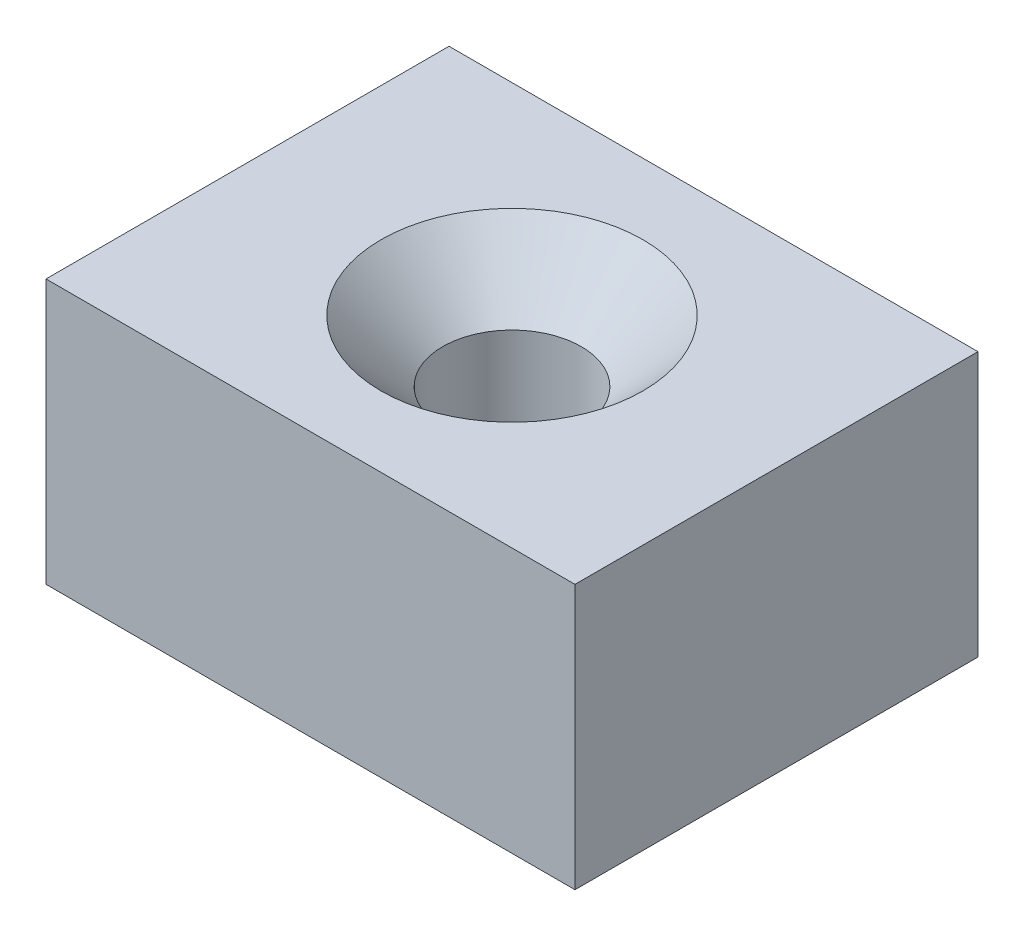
from build123d import *

# Parameters (mm, degrees)
SKETCH1_W                                           = 21
SKETCH1_H                                           = 10.5
BOSS_EXTRUDE1_DEPTH                                 = 16
CSK_FOR_M5_COUNTERSUNK_FLAT_HEAD_SCREW1_D           = 5.5
CSK_FOR_M5_COUNTERSUNK_FLAT_HEAD_SCREW1_CSINK_D     = 10.4
CSK_FOR_M5_COUNTERSUNK_FLAT_HEAD_SCREW1_CSINK_ANGLE = 90


with BuildPart() as part:
    # Sketch1 → Boss-Extrude1 (new body)
    with BuildSketch(Plane.XY):
        Rectangle(SKETCH1_W, SKETCH1_H)
    extrude(amount=BOSS_EXTRUDE1_DEPTH)

    # CSK for M5 Countersunk Flat Head Screw1 (through all)
    with Locations(Plane(origin=(0, 5.25, 0), x_dir=(1, 0, 0), z_dir=(0, 1, 0))):
        with Locations((0, -8)):
            CounterSinkHole(CSK_FOR_M5_COUNTERSUNK_FLAT_HEAD_SCREW1_D / 2, CSK_FOR_M5_COUNTERSUNK_FLAT_HEAD_SCREW1_CSINK_D / 2, counter_sink_angle=CSK_FOR_M5_COUNTERSUNK_FLAT_HEAD_SCREW1_CSINK_ANGLE)


solid = part.part
